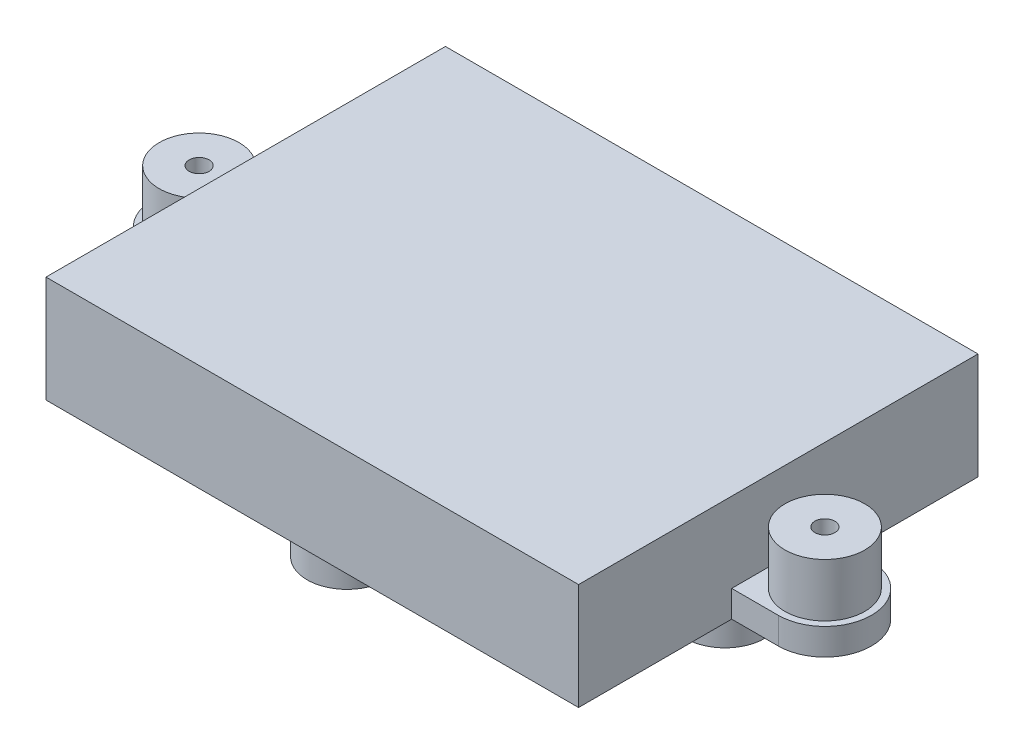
ISO-10303-21;
HEADER;
FILE_DESCRIPTION(('STEP AP214'),'2;1');
FILE_NAME('part.step','',(''),(''),'','','');
FILE_SCHEMA(('AUTOMOTIVE_DESIGN { 1 0 10303 214 1 1 1 1 }'));
ENDSEC;
DATA;
#1=APPLICATION_CONTEXT('core data for automotive mechanical design processes');
#2=APPLICATION_PROTOCOL_DEFINITION('international standard','automotive_design',2000,#1);
#3=PRODUCT_CONTEXT('',#1,'mechanical');
#4=PRODUCT('Part','Part','',(#3));
#5=PRODUCT_RELATED_PRODUCT_CATEGORY('part','',(#4));
#6=PRODUCT_DEFINITION_FORMATION('','',#4);
#7=PRODUCT_DEFINITION_CONTEXT('part definition',#1,'design');
#8=PRODUCT_DEFINITION('design','',#6,#7);
#9=PRODUCT_DEFINITION_SHAPE('','',#8);
#10=(LENGTH_UNIT() NAMED_UNIT(*) SI_UNIT(.MILLI.,.METRE.));
#11=(NAMED_UNIT(*) PLANE_ANGLE_UNIT() SI_UNIT($,.RADIAN.));
#12=(NAMED_UNIT(*) SI_UNIT($,.STERADIAN.) SOLID_ANGLE_UNIT());
#13=UNCERTAINTY_MEASURE_WITH_UNIT(LENGTH_MEASURE(1.E-05),#10,'distance_accuracy_value','');
#14=(GEOMETRIC_REPRESENTATION_CONTEXT(3) GLOBAL_UNCERTAINTY_ASSIGNED_CONTEXT((#13)) GLOBAL_UNIT_ASSIGNED_CONTEXT((#10,
#11,#12)) REPRESENTATION_CONTEXT('',''));
#15=CARTESIAN_POINT('',(0.,0.,0.));
#16=DIRECTION('',(0.,0.,1.));
#17=DIRECTION('',(1.,0.,0.));
#18=AXIS2_PLACEMENT_3D('',#15,#16,#17);
#19=CARTESIAN_POINT('',(-28.,-4.,15.));
#20=DIRECTION('',(0.,1.,0.));
#21=DIRECTION('',(0.,0.,1.));
#22=AXIS2_PLACEMENT_3D('',#19,#20,#21);
#23=PLANE('',#22);
#24=CARTESIAN_POINT('',(-1.9999999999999,-4.,10.3923048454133));
#25=DIRECTION('',(0.,-1.,0.));
#26=DIRECTION('',(0.866025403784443,0.,0.499999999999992));
#27=AXIS2_PLACEMENT_3D('',#24,#25,#26);
#28=CIRCLE('',#27,3.);
#29=CARTESIAN_POINT('',(0.765198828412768,-4.,11.555780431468));
#30=VERTEX_POINT('',#29);
#31=CARTESIAN_POINT('',(-4.39019882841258,-4.,8.57931020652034));
#32=VERTEX_POINT('',#31);
#33=EDGE_CURVE('E288',#30,#32,#28,.T.);
#34=ORIENTED_EDGE('',*,*,#33,.F.);
#35=CARTESIAN_POINT('',(4.,-4.,0.));
#36=DIRECTION('',(0.,1.,0.));
#37=DIRECTION('',(0.,0.,1.));
#38=AXIS2_PLACEMENT_3D('',#35,#36,#37);
#39=CIRCLE('',#38,12.);
#40=CARTESIAN_POINT('',(15.625,-4.,2.97647022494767));
#41=VERTEX_POINT('',#40);
#42=EDGE_CURVE('E222',#41,#30,#39,.F.);
#43=ORIENTED_EDGE('',*,*,#42,.F.);
#44=CARTESIAN_POINT('',(16.,-4.,0.));
#45=DIRECTION('',(0.,-1.,0.));
#46=DIRECTION('',(0.,0.,-1.));
#47=AXIS2_PLACEMENT_3D('',#44,#45,#46);
#48=CIRCLE('',#47,3.);
#49=CARTESIAN_POINT('',(15.625,-4.,-2.97647022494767));
#50=VERTEX_POINT('',#49);
#51=EDGE_CURVE('E309',#50,#41,#48,.T.);
#52=ORIENTED_EDGE('',*,*,#51,.F.);
#53=CARTESIAN_POINT('',(0.765198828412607,-4.,-11.5557804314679));
#54=VERTEX_POINT('',#53);
#55=EDGE_CURVE('E221',#54,#50,#39,.F.);
#56=ORIENTED_EDGE('',*,*,#55,.F.);
#57=CARTESIAN_POINT('',(-2.00000000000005,-4.,-10.3923048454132));
#58=DIRECTION('',(0.,-1.,0.));
#59=DIRECTION('',(-0.866025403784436,0.,0.500000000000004));
#60=AXIS2_PLACEMENT_3D('',#57,#58,#59);
#61=CIRCLE('',#60,3.);
#62=CARTESIAN_POINT('',(-4.3901988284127,-4.,-8.57931020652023));
#63=VERTEX_POINT('',#62);
#64=EDGE_CURVE('E301',#63,#54,#61,.T.);
#65=ORIENTED_EDGE('',*,*,#64,.F.);
#66=EDGE_CURVE('E226',#32,#63,#39,.F.);
#67=ORIENTED_EDGE('',*,*,#66,.F.);
#68=EDGE_LOOP('',(#34,#43,#52,#56,#65,#67));
#69=FACE_BOUND('',#68,.T.);
#70=CARTESIAN_POINT('',(23.5,-4.,0.));
#71=DIRECTION('',(0.,1.,0.));
#72=DIRECTION('',(0.,0.,1.));
#73=AXIS2_PLACEMENT_3D('',#70,#71,#72);
#74=CIRCLE('',#73,0.750000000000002);
#75=CARTESIAN_POINT('',(23.5,-4.,0.749999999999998));
#76=VERTEX_POINT('',#75);
#77=EDGE_CURVE('E186',#76,#76,#74,.T.);
#78=ORIENTED_EDGE('',*,*,#77,.T.);
#79=EDGE_LOOP('',(#78));
#80=FACE_BOUND('',#79,.T.);
#81=CARTESIAN_POINT('',(-23.5,-4.,0.));
#82=DIRECTION('',(0.,1.,0.));
#83=DIRECTION('',(0.,0.,-1.));
#84=AXIS2_PLACEMENT_3D('',#81,#82,#83);
#85=CIRCLE('',#84,0.750000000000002);
#86=CARTESIAN_POINT('',(-23.5,-4.,-0.749999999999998));
#87=VERTEX_POINT('',#86);
#88=EDGE_CURVE('E252',#87,#87,#85,.T.);
#89=ORIENTED_EDGE('',*,*,#88,.T.);
#90=EDGE_LOOP('',(#89));
#91=FACE_BOUND('',#90,.T.);
#92=DIRECTION('',(0.,0.,1.));
#93=VECTOR('',#92,1.);
#94=CARTESIAN_POINT('',(-20.,-4.,15.));
#95=LINE('',#94,#93);
#96=CARTESIAN_POINT('',(-20.,-4.,-15.));
#97=VERTEX_POINT('',#96);
#98=CARTESIAN_POINT('',(-20.,-4.,-3.5));
#99=VERTEX_POINT('',#98);
#100=EDGE_CURVE('E657',#97,#99,#95,.T.);
#101=ORIENTED_EDGE('',*,*,#100,.F.);
#102=DIRECTION('',(1.,0.,0.));
#103=VECTOR('',#102,1.);
#104=CARTESIAN_POINT('',(-28.,-4.,-15.));
#105=LINE('',#104,#103);
#106=CARTESIAN_POINT('',(20.,-4.,-15.));
#107=VERTEX_POINT('',#106);
#108=EDGE_CURVE('E208',#97,#107,#105,.T.);
#109=ORIENTED_EDGE('',*,*,#108,.T.);
#110=DIRECTION('',(0.,0.,1.));
#111=VECTOR('',#110,1.);
#112=CARTESIAN_POINT('',(20.,-4.,15.));
#113=LINE('',#112,#111);
#114=CARTESIAN_POINT('',(20.,-4.,-3.5));
#115=VERTEX_POINT('',#114);
#116=EDGE_CURVE('E285',#107,#115,#113,.T.);
#117=ORIENTED_EDGE('',*,*,#116,.T.);
#118=DIRECTION('',(1.,0.,0.));
#119=VECTOR('',#118,1.);
#120=CARTESIAN_POINT('',(-28.,-4.,-3.49999999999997));
#121=LINE('',#120,#119);
#122=CARTESIAN_POINT('',(23.5,-4.,-3.5));
#123=VERTEX_POINT('',#122);
#124=EDGE_CURVE('E639',#115,#123,#121,.T.);
#125=ORIENTED_EDGE('',*,*,#124,.T.);
#126=CARTESIAN_POINT('',(23.5,-4.,0.));
#127=DIRECTION('',(0.,1.,0.));
#128=DIRECTION('',(0.,0.,1.));
#129=AXIS2_PLACEMENT_3D('',#126,#127,#128);
#130=CIRCLE('',#129,3.5);
#131=CARTESIAN_POINT('',(23.5,-4.,3.5));
#132=VERTEX_POINT('',#131);
#133=EDGE_CURVE('E290',#123,#132,#130,.F.);
#134=ORIENTED_EDGE('',*,*,#133,.T.);
#135=DIRECTION('',(-1.,0.,0.));
#136=VECTOR('',#135,1.);
#137=CARTESIAN_POINT('',(-28.,-4.,3.49999999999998));
#138=LINE('',#137,#136);
#139=CARTESIAN_POINT('',(20.,-4.,3.5));
#140=VERTEX_POINT('',#139);
#141=EDGE_CURVE('E284',#132,#140,#138,.T.);
#142=ORIENTED_EDGE('',*,*,#141,.T.);
#143=DIRECTION('',(0.,0.,1.));
#144=VECTOR('',#143,1.);
#145=CARTESIAN_POINT('',(20.,-4.,15.));
#146=LINE('',#145,#144);
#147=CARTESIAN_POINT('',(20.,-4.,15.));
#148=VERTEX_POINT('',#147);
#149=EDGE_CURVE('E278',#140,#148,#146,.T.);
#150=ORIENTED_EDGE('',*,*,#149,.T.);
#151=DIRECTION('',(1.,0.,0.));
#152=VECTOR('',#151,1.);
#153=CARTESIAN_POINT('',(-28.,-4.,15.));
#154=LINE('',#153,#152);
#155=CARTESIAN_POINT('',(-20.,-4.,15.));
#156=VERTEX_POINT('',#155);
#157=EDGE_CURVE('E213',#156,#148,#154,.T.);
#158=ORIENTED_EDGE('',*,*,#157,.F.);
#159=DIRECTION('',(0.,0.,1.));
#160=VECTOR('',#159,1.);
#161=CARTESIAN_POINT('',(-20.,-4.,15.));
#162=LINE('',#161,#160);
#163=CARTESIAN_POINT('',(-20.,-4.,3.5));
#164=VERTEX_POINT('',#163);
#165=EDGE_CURVE('E624',#164,#156,#162,.T.);
#166=ORIENTED_EDGE('',*,*,#165,.F.);
#167=DIRECTION('',(1.,0.,0.));
#168=VECTOR('',#167,1.);
#169=CARTESIAN_POINT('',(-28.,-4.,3.5));
#170=LINE('',#169,#168);
#171=CARTESIAN_POINT('',(-23.5,-4.,3.5));
#172=VERTEX_POINT('',#171);
#173=EDGE_CURVE('E162',#172,#164,#170,.T.);
#174=ORIENTED_EDGE('',*,*,#173,.F.);
#175=CARTESIAN_POINT('',(-23.5,-4.,0.));
#176=DIRECTION('',(0.,1.,0.));
#177=DIRECTION('',(0.,0.,1.));
#178=AXIS2_PLACEMENT_3D('',#175,#176,#177);
#179=CIRCLE('',#178,3.5);
#180=CARTESIAN_POINT('',(-23.5,-4.,-3.5));
#181=VERTEX_POINT('',#180);
#182=EDGE_CURVE('E620',#181,#172,#179,.T.);
#183=ORIENTED_EDGE('',*,*,#182,.F.);
#184=DIRECTION('',(-1.,0.,0.));
#185=VECTOR('',#184,1.);
#186=CARTESIAN_POINT('',(-28.,-4.,-3.5));
#187=LINE('',#186,#185);
#188=EDGE_CURVE('E615',#99,#181,#187,.T.);
#189=ORIENTED_EDGE('',*,*,#188,.F.);
#190=EDGE_LOOP('',(#101,#109,#117,#125,#134,#142,#150,#158,#166,#174,#183,#189));
#191=FACE_BOUND('',#190,.T.);
#192=ADVANCED_FACE('F31',(#69,#80,#91,#191),#23,.F.);
#193=CARTESIAN_POINT('',(-20.,-2.,15.));
#194=DIRECTION('',(0.,1.,0.));
#195=DIRECTION('',(0.,0.,1.));
#196=AXIS2_PLACEMENT_3D('',#193,#194,#195);
#197=PLANE('',#196);
#198=CARTESIAN_POINT('',(-23.5,-2.,0.));
#199=DIRECTION('',(0.,1.,0.));
#200=DIRECTION('',(0.,0.,-1.));
#201=AXIS2_PLACEMENT_3D('',#198,#199,#200);
#202=CIRCLE('',#201,3.);
#203=CARTESIAN_POINT('',(-23.5,-2.,-3.));
#204=VERTEX_POINT('',#203);
#205=EDGE_CURVE('E256',#204,#204,#202,.T.);
#206=ORIENTED_EDGE('',*,*,#205,.F.);
#207=EDGE_LOOP('',(#206));
#208=FACE_BOUND('',#207,.T.);
#209=DIRECTION('',(0.,0.,-1.));
#210=VECTOR('',#209,1.);
#211=CARTESIAN_POINT('',(-20.,-2.,15.));
#212=LINE('',#211,#210);
#213=CARTESIAN_POINT('',(-20.,-2.,3.5));
#214=VERTEX_POINT('',#213);
#215=CARTESIAN_POINT('',(-20.,-2.,-3.5));
#216=VERTEX_POINT('',#215);
#217=EDGE_CURVE('E174',#214,#216,#212,.T.);
#218=ORIENTED_EDGE('',*,*,#217,.T.);
#219=DIRECTION('',(-1.,0.,0.));
#220=VECTOR('',#219,1.);
#221=CARTESIAN_POINT('',(-20.,-2.,-3.5));
#222=LINE('',#221,#220);
#223=CARTESIAN_POINT('',(-23.5,-2.,-3.5));
#224=VERTEX_POINT('',#223);
#225=EDGE_CURVE('E168',#216,#224,#222,.T.);
#226=ORIENTED_EDGE('',*,*,#225,.T.);
#227=CARTESIAN_POINT('',(-23.5,-2.,0.));
#228=DIRECTION('',(0.,1.,0.));
#229=DIRECTION('',(0.,0.,-1.));
#230=AXIS2_PLACEMENT_3D('',#227,#228,#229);
#231=CIRCLE('',#230,3.5);
#232=CARTESIAN_POINT('',(-23.5,-2.,3.5));
#233=VERTEX_POINT('',#232);
#234=EDGE_CURVE('E176',#224,#233,#231,.T.);
#235=ORIENTED_EDGE('',*,*,#234,.T.);
#236=DIRECTION('',(1.,0.,0.));
#237=VECTOR('',#236,1.);
#238=CARTESIAN_POINT('',(-20.,-2.,3.5));
#239=LINE('',#238,#237);
#240=EDGE_CURVE('E159',#233,#214,#239,.T.);
#241=ORIENTED_EDGE('',*,*,#240,.T.);
#242=EDGE_LOOP('',(#218,#226,#235,#241));
#243=FACE_BOUND('',#242,.T.);
#244=ADVANCED_FACE('F172',(#208,#243),#197,.T.);
#245=CARTESIAN_POINT('',(-28.,-4.,15.));
#246=DIRECTION('',(0.,0.,1.));
#247=DIRECTION('',(1.,0.,0.));
#248=AXIS2_PLACEMENT_3D('',#245,#246,#247);
#249=PLANE('',#248);
#250=DIRECTION('',(0.,-1.,0.));
#251=VECTOR('',#250,1.);
#252=CARTESIAN_POINT('',(-20.,4.,15.));
#253=LINE('',#252,#251);
#254=CARTESIAN_POINT('',(-20.,4.,15.));
#255=VERTEX_POINT('',#254);
#256=EDGE_CURVE('E264',#255,#156,#253,.T.);
#257=ORIENTED_EDGE('',*,*,#256,.T.);
#258=ORIENTED_EDGE('',*,*,#157,.T.);
#259=DIRECTION('',(0.,-1.,0.));
#260=VECTOR('',#259,1.);
#261=CARTESIAN_POINT('',(20.,4.,15.));
#262=LINE('',#261,#260);
#263=CARTESIAN_POINT('',(20.,4.,15.));
#264=VERTEX_POINT('',#263);
#265=EDGE_CURVE('E198',#264,#148,#262,.T.);
#266=ORIENTED_EDGE('',*,*,#265,.F.);
#267=DIRECTION('',(-1.,0.,0.));
#268=VECTOR('',#267,1.);
#269=CARTESIAN_POINT('',(-28.,4.,15.));
#270=LINE('',#269,#268);
#271=EDGE_CURVE('E215',#264,#255,#270,.T.);
#272=ORIENTED_EDGE('',*,*,#271,.T.);
#273=EDGE_LOOP('',(#257,#258,#266,#272));
#274=FACE_BOUND('',#273,.T.);
#275=ADVANCED_FACE('F273',(#274),#249,.T.);
#276=CARTESIAN_POINT('',(-28.,-4.,-15.));
#277=DIRECTION('',(0.,0.,1.));
#278=DIRECTION('',(1.,0.,0.));
#279=AXIS2_PLACEMENT_3D('',#276,#277,#278);
#280=PLANE('',#279);
#281=ORIENTED_EDGE('',*,*,#108,.F.);
#282=DIRECTION('',(0.,1.,0.));
#283=VECTOR('',#282,1.);
#284=CARTESIAN_POINT('',(-20.,4.,-15.));
#285=LINE('',#284,#283);
#286=CARTESIAN_POINT('',(-20.,4.,-15.));
#287=VERTEX_POINT('',#286);
#288=EDGE_CURVE('E183',#97,#287,#285,.T.);
#289=ORIENTED_EDGE('',*,*,#288,.T.);
#290=DIRECTION('',(-1.,0.,0.));
#291=VECTOR('',#290,1.);
#292=CARTESIAN_POINT('',(-28.,4.,-15.));
#293=LINE('',#292,#291);
#294=CARTESIAN_POINT('',(20.,4.,-15.));
#295=VERTEX_POINT('',#294);
#296=EDGE_CURVE('E210',#295,#287,#293,.T.);
#297=ORIENTED_EDGE('',*,*,#296,.F.);
#298=DIRECTION('',(0.,1.,0.));
#299=VECTOR('',#298,1.);
#300=CARTESIAN_POINT('',(20.,4.,-15.));
#301=LINE('',#300,#299);
#302=EDGE_CURVE('E204',#107,#295,#301,.T.);
#303=ORIENTED_EDGE('',*,*,#302,.F.);
#304=EDGE_LOOP('',(#281,#289,#297,#303));
#305=FACE_BOUND('',#304,.T.);
#306=ADVANCED_FACE('F354',(#305),#280,.F.);
#307=CARTESIAN_POINT('',(4.,-6.,0.));
#308=DIRECTION('',(0.,1.,0.));
#309=DIRECTION('',(0.,0.,1.));
#310=AXIS2_PLACEMENT_3D('',#307,#308,#309);
#311=CYLINDRICAL_SURFACE('',#310,12.);
#312=DIRECTION('',(0.,1.,0.));
#313=VECTOR('',#312,1.);
#314=CARTESIAN_POINT('',(0.765198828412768,-5.75,11.555780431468));
#315=LINE('',#314,#313);
#316=CARTESIAN_POINT('',(0.765198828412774,-6.,11.555780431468));
#317=VERTEX_POINT('',#316);
#318=EDGE_CURVE('E299',#317,#30,#315,.T.);
#319=ORIENTED_EDGE('',*,*,#318,.F.);
#320=CARTESIAN_POINT('',(4.,-6.,0.));
#321=DIRECTION('',(0.,-1.,0.));
#322=DIRECTION('',(0.,0.,-1.));
#323=AXIS2_PLACEMENT_3D('',#320,#321,#322);
#324=CIRCLE('',#323,12.);
#325=CARTESIAN_POINT('',(15.625,-6.,2.97647022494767));
#326=VERTEX_POINT('',#325);
#327=EDGE_CURVE('E245',#326,#317,#324,.T.);
#328=ORIENTED_EDGE('',*,*,#327,.F.);
#329=DIRECTION('',(0.,1.,0.));
#330=VECTOR('',#329,1.);
#331=CARTESIAN_POINT('',(15.625,-5.75,2.97647022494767));
#332=LINE('',#331,#330);
#333=EDGE_CURVE('E246',#41,#326,#332,.F.);
#334=ORIENTED_EDGE('',*,*,#333,.F.);
#335=ORIENTED_EDGE('',*,*,#42,.T.);
#336=EDGE_LOOP('',(#319,#328,#334,#335));
#337=FACE_BOUND('',#336,.T.);
#338=ADVANCED_FACE('F321',(#337),#311,.T.);
#339=DIRECTION('',(0.,1.,0.));
#340=VECTOR('',#339,1.);
#341=CARTESIAN_POINT('',(-4.39019882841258,-5.75,8.57931020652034));
#342=LINE('',#341,#340);
#343=CARTESIAN_POINT('',(-4.39019882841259,-6.,8.57931020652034));
#344=VERTEX_POINT('',#343);
#345=EDGE_CURVE('E45',#32,#344,#342,.F.);
#346=ORIENTED_EDGE('',*,*,#345,.F.);
#347=ORIENTED_EDGE('',*,*,#66,.T.);
#348=DIRECTION('',(0.,1.,0.));
#349=VECTOR('',#348,1.);
#350=CARTESIAN_POINT('',(-4.3901988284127,-5.75,-8.57931020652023));
#351=LINE('',#350,#349);
#352=CARTESIAN_POINT('',(-4.3901988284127,-6.,-8.57931020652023));
#353=VERTEX_POINT('',#352);
#354=EDGE_CURVE('E307',#353,#63,#351,.T.);
#355=ORIENTED_EDGE('',*,*,#354,.F.);
#356=EDGE_CURVE('E235',#344,#353,#324,.T.);
#357=ORIENTED_EDGE('',*,*,#356,.F.);
#358=EDGE_LOOP('',(#346,#347,#355,#357));
#359=FACE_BOUND('',#358,.T.);
#360=ADVANCED_FACE('F329',(#359),#311,.T.);
#361=CARTESIAN_POINT('',(4.,-6.,0.));
#362=DIRECTION('',(0.,-1.,0.));
#363=DIRECTION('',(0.,0.,-1.));
#364=AXIS2_PLACEMENT_3D('',#361,#362,#363);
#365=PLANE('',#364);
#366=ORIENTED_EDGE('',*,*,#327,.T.);
#367=CARTESIAN_POINT('',(-1.9999999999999,-6.,10.3923048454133));
#368=DIRECTION('',(0.,-1.,0.));
#369=DIRECTION('',(0.,0.,-1.));
#370=AXIS2_PLACEMENT_3D('',#367,#368,#369);
#371=CIRCLE('',#370,3.);
#372=EDGE_CURVE('E11',#317,#344,#371,.F.);
#373=ORIENTED_EDGE('',*,*,#372,.T.);
#374=ORIENTED_EDGE('',*,*,#356,.T.);
#375=CARTESIAN_POINT('',(-2.00000000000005,-6.,-10.3923048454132));
#376=DIRECTION('',(0.,-1.,0.));
#377=DIRECTION('',(0.,0.,-1.));
#378=AXIS2_PLACEMENT_3D('',#375,#376,#377);
#379=CIRCLE('',#378,3.);
#380=CARTESIAN_POINT('',(0.765198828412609,-6.,-11.5557804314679));
#381=VERTEX_POINT('',#380);
#382=EDGE_CURVE('E38',#353,#381,#379,.F.);
#383=ORIENTED_EDGE('',*,*,#382,.T.);
#384=CARTESIAN_POINT('',(15.625,-6.,-2.97647022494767));
#385=VERTEX_POINT('',#384);
#386=EDGE_CURVE('E232',#381,#385,#324,.T.);
#387=ORIENTED_EDGE('',*,*,#386,.T.);
#388=CARTESIAN_POINT('',(16.,-6.,0.));
#389=DIRECTION('',(0.,-1.,0.));
#390=DIRECTION('',(0.,0.,-1.));
#391=AXIS2_PLACEMENT_3D('',#388,#389,#390);
#392=CIRCLE('',#391,3.);
#393=EDGE_CURVE('E225',#385,#326,#392,.F.);
#394=ORIENTED_EDGE('',*,*,#393,.T.);
#395=EDGE_LOOP('',(#366,#373,#374,#383,#387,#394));
#396=FACE_BOUND('',#395,.T.);
#397=ADVANCED_FACE('F231',(#396),#365,.T.);
#398=DIRECTION('',(0.,1.,0.));
#399=VECTOR('',#398,1.);
#400=CARTESIAN_POINT('',(0.765198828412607,-5.75,-11.5557804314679));
#401=LINE('',#400,#399);
#402=EDGE_CURVE('E52',#54,#381,#401,.F.);
#403=ORIENTED_EDGE('',*,*,#402,.F.);
#404=ORIENTED_EDGE('',*,*,#55,.T.);
#405=DIRECTION('',(0.,1.,0.));
#406=VECTOR('',#405,1.);
#407=CARTESIAN_POINT('',(15.625,-5.75,-2.97647022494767));
#408=LINE('',#407,#406);
#409=EDGE_CURVE('E243',#385,#50,#408,.T.);
#410=ORIENTED_EDGE('',*,*,#409,.F.);
#411=ORIENTED_EDGE('',*,*,#386,.F.);
#412=EDGE_LOOP('',(#403,#404,#410,#411));
#413=FACE_BOUND('',#412,.T.);
#414=ADVANCED_FACE('F240',(#413),#311,.T.);
#415=CARTESIAN_POINT('',(-23.5,2.,0.));
#416=DIRECTION('',(0.,1.,0.));
#417=DIRECTION('',(0.,0.,-1.));
#418=AXIS2_PLACEMENT_3D('',#415,#416,#417);
#419=PLANE('',#418);
#420=CARTESIAN_POINT('',(-23.5,2.,0.));
#421=DIRECTION('',(0.,1.,0.));
#422=DIRECTION('',(0.,0.,-1.));
#423=AXIS2_PLACEMENT_3D('',#420,#421,#422);
#424=CIRCLE('',#423,3.);
#425=CARTESIAN_POINT('',(-23.5,2.,-3.));
#426=VERTEX_POINT('',#425);
#427=EDGE_CURVE('E261',#426,#426,#424,.T.);
#428=ORIENTED_EDGE('',*,*,#427,.T.);
#429=EDGE_LOOP('',(#428));
#430=FACE_BOUND('',#429,.T.);
#431=CARTESIAN_POINT('',(-23.5,2.,0.));
#432=DIRECTION('',(0.,-1.,0.));
#433=DIRECTION('',(0.,0.,1.));
#434=AXIS2_PLACEMENT_3D('',#431,#432,#433);
#435=CIRCLE('',#434,0.750000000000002);
#436=CARTESIAN_POINT('',(-23.5,2.,0.749999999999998));
#437=VERTEX_POINT('',#436);
#438=EDGE_CURVE('E249',#437,#437,#435,.T.);
#439=ORIENTED_EDGE('',*,*,#438,.T.);
#440=EDGE_LOOP('',(#439));
#441=FACE_BOUND('',#440,.T.);
#442=ADVANCED_FACE('F385',(#430,#441),#419,.T.);
#443=CARTESIAN_POINT('',(-23.5,-4.,0.));
#444=DIRECTION('',(0.,1.,0.));
#445=DIRECTION('',(0.,0.,1.));
#446=AXIS2_PLACEMENT_3D('',#443,#444,#445);
#447=CYLINDRICAL_SURFACE('',#446,0.750000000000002);
#448=ORIENTED_EDGE('',*,*,#88,.F.);
#449=EDGE_LOOP('',(#448));
#450=FACE_BOUND('',#449,.T.);
#451=ORIENTED_EDGE('',*,*,#438,.F.);
#452=EDGE_LOOP('',(#451));
#453=FACE_BOUND('',#452,.T.);
#454=ADVANCED_FACE('F381',(#450,#453),#447,.F.);
#455=CARTESIAN_POINT('',(-28.,4.,15.));
#456=DIRECTION('',(0.,-1.,0.));
#457=DIRECTION('',(0.,0.,-1.));
#458=AXIS2_PLACEMENT_3D('',#455,#456,#457);
#459=PLANE('',#458);
#460=DIRECTION('',(0.,0.,1.));
#461=VECTOR('',#460,1.);
#462=CARTESIAN_POINT('',(-20.,4.,15.));
#463=LINE('',#462,#461);
#464=EDGE_CURVE('E189',#287,#255,#463,.T.);
#465=ORIENTED_EDGE('',*,*,#464,.T.);
#466=ORIENTED_EDGE('',*,*,#271,.F.);
#467=DIRECTION('',(0.,0.,1.));
#468=VECTOR('',#467,1.);
#469=CARTESIAN_POINT('',(20.,4.,15.));
#470=LINE('',#469,#468);
#471=EDGE_CURVE('E206',#295,#264,#470,.T.);
#472=ORIENTED_EDGE('',*,*,#471,.F.);
#473=ORIENTED_EDGE('',*,*,#296,.T.);
#474=EDGE_LOOP('',(#465,#466,#472,#473));
#475=FACE_BOUND('',#474,.T.);
#476=ADVANCED_FACE('F268',(#475),#459,.F.);
#477=CARTESIAN_POINT('',(23.5,2.,0.));
#478=DIRECTION('',(0.,1.,0.));
#479=DIRECTION('',(0.,0.,1.));
#480=AXIS2_PLACEMENT_3D('',#477,#478,#479);
#481=PLANE('',#480);
#482=CARTESIAN_POINT('',(23.5,2.,0.));
#483=DIRECTION('',(0.,1.,0.));
#484=DIRECTION('',(0.,0.,1.));
#485=AXIS2_PLACEMENT_3D('',#482,#483,#484);
#486=CIRCLE('',#485,3.);
#487=CARTESIAN_POINT('',(23.5,2.,3.));
#488=VERTEX_POINT('',#487);
#489=EDGE_CURVE('E195',#488,#488,#486,.T.);
#490=ORIENTED_EDGE('',*,*,#489,.T.);
#491=EDGE_LOOP('',(#490));
#492=FACE_BOUND('',#491,.T.);
#493=CARTESIAN_POINT('',(23.5,2.,0.));
#494=DIRECTION('',(0.,-1.,0.));
#495=DIRECTION('',(0.,0.,-1.));
#496=AXIS2_PLACEMENT_3D('',#493,#494,#495);
#497=CIRCLE('',#496,0.750000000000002);
#498=CARTESIAN_POINT('',(23.5,2.,-0.749999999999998));
#499=VERTEX_POINT('',#498);
#500=EDGE_CURVE('E182',#499,#499,#497,.T.);
#501=ORIENTED_EDGE('',*,*,#500,.T.);
#502=EDGE_LOOP('',(#501));
#503=FACE_BOUND('',#502,.T.);
#504=ADVANCED_FACE('F364',(#492,#503),#481,.T.);
#505=CARTESIAN_POINT('',(23.5,-4.,0.));
#506=DIRECTION('',(0.,1.,0.));
#507=DIRECTION('',(0.,0.,1.));
#508=AXIS2_PLACEMENT_3D('',#505,#506,#507);
#509=CYLINDRICAL_SURFACE('',#508,0.750000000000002);
#510=ORIENTED_EDGE('',*,*,#77,.F.);
#511=EDGE_LOOP('',(#510));
#512=FACE_BOUND('',#511,.T.);
#513=ORIENTED_EDGE('',*,*,#500,.F.);
#514=EDGE_LOOP('',(#513));
#515=FACE_BOUND('',#514,.T.);
#516=ADVANCED_FACE('F360',(#512,#515),#509,.F.);
#517=CARTESIAN_POINT('',(20.,-2.,15.));
#518=DIRECTION('',(0.,-1.,0.));
#519=DIRECTION('',(0.,0.,-1.));
#520=AXIS2_PLACEMENT_3D('',#517,#518,#519);
#521=PLANE('',#520);
#522=DIRECTION('',(0.,0.,-1.));
#523=VECTOR('',#522,1.);
#524=CARTESIAN_POINT('',(20.,-2.,15.));
#525=LINE('',#524,#523);
#526=CARTESIAN_POINT('',(20.,-2.,3.5));
#527=VERTEX_POINT('',#526);
#528=CARTESIAN_POINT('',(20.,-2.,-3.5));
#529=VERTEX_POINT('',#528);
#530=EDGE_CURVE('E201',#527,#529,#525,.T.);
#531=ORIENTED_EDGE('',*,*,#530,.F.);
#532=DIRECTION('',(-1.,0.,0.));
#533=VECTOR('',#532,1.);
#534=CARTESIAN_POINT('',(20.,-2.,3.5));
#535=LINE('',#534,#533);
#536=CARTESIAN_POINT('',(23.5,-2.,3.5));
#537=VERTEX_POINT('',#536);
#538=EDGE_CURVE('E633',#537,#527,#535,.T.);
#539=ORIENTED_EDGE('',*,*,#538,.F.);
#540=CARTESIAN_POINT('',(23.5,-2.,0.));
#541=DIRECTION('',(0.,-1.,0.));
#542=DIRECTION('',(0.,0.,-1.));
#543=AXIS2_PLACEMENT_3D('',#540,#541,#542);
#544=CIRCLE('',#543,3.5);
#545=CARTESIAN_POINT('',(23.5,-2.,-3.5));
#546=VERTEX_POINT('',#545);
#547=EDGE_CURVE('E630',#546,#537,#544,.T.);
#548=ORIENTED_EDGE('',*,*,#547,.F.);
#549=DIRECTION('',(1.,0.,0.));
#550=VECTOR('',#549,1.);
#551=CARTESIAN_POINT('',(20.,-2.,-3.5));
#552=LINE('',#551,#550);
#553=EDGE_CURVE('E619',#529,#546,#552,.T.);
#554=ORIENTED_EDGE('',*,*,#553,.F.);
#555=EDGE_LOOP('',(#531,#539,#548,#554));
#556=FACE_BOUND('',#555,.T.);
#557=CARTESIAN_POINT('',(23.5,-2.,0.));
#558=DIRECTION('',(0.,-1.,0.));
#559=DIRECTION('',(0.,0.,-1.));
#560=AXIS2_PLACEMENT_3D('',#557,#558,#559);
#561=CIRCLE('',#560,3.);
#562=CARTESIAN_POINT('',(23.5,-2.,-3.00000000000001));
#563=VERTEX_POINT('',#562);
#564=EDGE_CURVE('E218',#563,#563,#561,.F.);
#565=ORIENTED_EDGE('',*,*,#564,.F.);
#566=EDGE_LOOP('',(#565));
#567=FACE_BOUND('',#566,.T.);
#568=ADVANCED_FACE('F363',(#556,#567),#521,.F.);
#569=CARTESIAN_POINT('',(20.,-2.,15.));
#570=DIRECTION('',(1.,0.,0.));
#571=DIRECTION('',(0.,0.,-1.));
#572=AXIS2_PLACEMENT_3D('',#569,#570,#571);
#573=PLANE('',#572);
#574=ORIENTED_EDGE('',*,*,#265,.T.);
#575=ORIENTED_EDGE('',*,*,#149,.F.);
#576=DIRECTION('',(0.,1.,0.));
#577=VECTOR('',#576,1.);
#578=CARTESIAN_POINT('',(20.,-7.5,3.5));
#579=LINE('',#578,#577);
#580=EDGE_CURVE('E637',#140,#527,#579,.T.);
#581=ORIENTED_EDGE('',*,*,#580,.T.);
#582=ORIENTED_EDGE('',*,*,#530,.T.);
#583=DIRECTION('',(0.,1.,0.));
#584=VECTOR('',#583,1.);
#585=CARTESIAN_POINT('',(20.,-7.5,-3.5));
#586=LINE('',#585,#584);
#587=EDGE_CURVE('E636',#115,#529,#586,.T.);
#588=ORIENTED_EDGE('',*,*,#587,.F.);
#589=ORIENTED_EDGE('',*,*,#116,.F.);
#590=ORIENTED_EDGE('',*,*,#302,.T.);
#591=ORIENTED_EDGE('',*,*,#471,.T.);
#592=EDGE_LOOP('',(#574,#575,#581,#582,#588,#589,#590,#591));
#593=FACE_BOUND('',#592,.T.);
#594=ADVANCED_FACE('F277',(#593),#573,.T.);
#595=CARTESIAN_POINT('',(23.5,2.,0.));
#596=DIRECTION('',(0.,-1.,0.));
#597=DIRECTION('',(0.,0.,-1.));
#598=AXIS2_PLACEMENT_3D('',#595,#596,#597);
#599=CYLINDRICAL_SURFACE('',#598,3.);
#600=ORIENTED_EDGE('',*,*,#489,.F.);
#601=EDGE_LOOP('',(#600));
#602=FACE_BOUND('',#601,.T.);
#603=ORIENTED_EDGE('',*,*,#564,.T.);
#604=EDGE_LOOP('',(#603));
#605=FACE_BOUND('',#604,.T.);
#606=ADVANCED_FACE('F369',(#602,#605),#599,.T.);
#607=CARTESIAN_POINT('',(-20.,-2.,15.));
#608=DIRECTION('',(-1.,0.,0.));
#609=DIRECTION('',(0.,0.,-1.));
#610=AXIS2_PLACEMENT_3D('',#607,#608,#609);
#611=PLANE('',#610);
#612=ORIENTED_EDGE('',*,*,#256,.F.);
#613=ORIENTED_EDGE('',*,*,#464,.F.);
#614=ORIENTED_EDGE('',*,*,#288,.F.);
#615=ORIENTED_EDGE('',*,*,#100,.T.);
#616=DIRECTION('',(0.,1.,0.));
#617=VECTOR('',#616,1.);
#618=CARTESIAN_POINT('',(-20.,-7.5,-3.5));
#619=LINE('',#618,#617);
#620=EDGE_CURVE('E180',#99,#216,#619,.T.);
#621=ORIENTED_EDGE('',*,*,#620,.T.);
#622=ORIENTED_EDGE('',*,*,#217,.F.);
#623=DIRECTION('',(0.,1.,0.));
#624=VECTOR('',#623,1.);
#625=CARTESIAN_POINT('',(-20.,-7.5,3.5));
#626=LINE('',#625,#624);
#627=EDGE_CURVE('E155',#164,#214,#626,.T.);
#628=ORIENTED_EDGE('',*,*,#627,.F.);
#629=ORIENTED_EDGE('',*,*,#165,.T.);
#630=EDGE_LOOP('',(#612,#613,#614,#615,#621,#622,#628,#629));
#631=FACE_BOUND('',#630,.T.);
#632=ADVANCED_FACE('F178',(#631),#611,.T.);
#633=CARTESIAN_POINT('',(-23.5,2.,0.));
#634=DIRECTION('',(0.,-1.,0.));
#635=DIRECTION('',(0.,0.,-1.));
#636=AXIS2_PLACEMENT_3D('',#633,#634,#635);
#637=CYLINDRICAL_SURFACE('',#636,3.);
#638=ORIENTED_EDGE('',*,*,#427,.F.);
#639=EDGE_LOOP('',(#638));
#640=FACE_BOUND('',#639,.T.);
#641=ORIENTED_EDGE('',*,*,#205,.T.);
#642=EDGE_LOOP('',(#641));
#643=FACE_BOUND('',#642,.T.);
#644=ADVANCED_FACE('F397',(#640,#643),#637,.T.);
#645=CARTESIAN_POINT('',(16.,-7.5,0.));
#646=DIRECTION('',(0.,1.,0.));
#647=DIRECTION('',(0.,0.,1.));
#648=AXIS2_PLACEMENT_3D('',#645,#646,#647);
#649=CYLINDRICAL_SURFACE('',#648,3.);
#650=CARTESIAN_POINT('',(16.,-7.5,0.));
#651=DIRECTION('',(0.,-1.,0.));
#652=DIRECTION('',(0.,0.,-1.));
#653=AXIS2_PLACEMENT_3D('',#650,#651,#652);
#654=CIRCLE('',#653,3.);
#655=CARTESIAN_POINT('',(16.,-7.5,-3.));
#656=VERTEX_POINT('',#655);
#657=EDGE_CURVE('E311',#656,#656,#654,.T.);
#658=ORIENTED_EDGE('',*,*,#657,.F.);
#659=EDGE_LOOP('',(#658));
#660=FACE_BOUND('',#659,.T.);
#661=ORIENTED_EDGE('',*,*,#393,.F.);
#662=ORIENTED_EDGE('',*,*,#409,.T.);
#663=ORIENTED_EDGE('',*,*,#51,.T.);
#664=ORIENTED_EDGE('',*,*,#333,.T.);
#665=EDGE_LOOP('',(#661,#662,#663,#664));
#666=FACE_BOUND('',#665,.T.);
#667=ADVANCED_FACE('F316',(#660,#666),#649,.T.);
#668=CARTESIAN_POINT('',(16.,-7.5,0.));
#669=DIRECTION('',(0.,-1.,0.));
#670=DIRECTION('',(0.,0.,-1.));
#671=AXIS2_PLACEMENT_3D('',#668,#669,#670);
#672=PLANE('',#671);
#673=ORIENTED_EDGE('',*,*,#657,.T.);
#674=EDGE_LOOP('',(#673));
#675=FACE_BOUND('',#674,.T.);
#676=ADVANCED_FACE('F333',(#675),#672,.T.);
#677=CARTESIAN_POINT('',(-2.00000000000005,-7.5,-10.3923048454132));
#678=DIRECTION('',(0.,1.,0.));
#679=DIRECTION('',(0.,0.,1.));
#680=AXIS2_PLACEMENT_3D('',#677,#678,#679);
#681=CYLINDRICAL_SURFACE('',#680,3.);
#682=CARTESIAN_POINT('',(-2.00000000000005,-7.5,-10.3923048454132));
#683=DIRECTION('',(0.,-1.,0.));
#684=DIRECTION('',(-0.866025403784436,0.,0.500000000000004));
#685=AXIS2_PLACEMENT_3D('',#682,#683,#684);
#686=CIRCLE('',#685,3.);
#687=CARTESIAN_POINT('',(-4.59807621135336,-7.5,-8.89230484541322));
#688=VERTEX_POINT('',#687);
#689=EDGE_CURVE('E303',#688,#688,#686,.T.);
#690=ORIENTED_EDGE('',*,*,#689,.F.);
#691=EDGE_LOOP('',(#690));
#692=FACE_BOUND('',#691,.T.);
#693=ORIENTED_EDGE('',*,*,#382,.F.);
#694=ORIENTED_EDGE('',*,*,#354,.T.);
#695=ORIENTED_EDGE('',*,*,#64,.T.);
#696=ORIENTED_EDGE('',*,*,#402,.T.);
#697=EDGE_LOOP('',(#693,#694,#695,#696));
#698=FACE_BOUND('',#697,.T.);
#699=ADVANCED_FACE('F330',(#692,#698),#681,.T.);
#700=CARTESIAN_POINT('',(-2.00000000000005,-7.5,-10.3923048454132));
#701=DIRECTION('',(0.,-1.,0.));
#702=DIRECTION('',(-0.866025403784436,0.,0.500000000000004));
#703=AXIS2_PLACEMENT_3D('',#700,#701,#702);
#704=PLANE('',#703);
#705=ORIENTED_EDGE('',*,*,#689,.T.);
#706=EDGE_LOOP('',(#705));
#707=FACE_BOUND('',#706,.T.);
#708=ADVANCED_FACE('F332',(#707),#704,.T.);
#709=CARTESIAN_POINT('',(-1.9999999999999,-7.5,10.3923048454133));
#710=DIRECTION('',(0.,1.,0.));
#711=DIRECTION('',(0.,0.,1.));
#712=AXIS2_PLACEMENT_3D('',#709,#710,#711);
#713=CYLINDRICAL_SURFACE('',#712,3.);
#714=CARTESIAN_POINT('',(-1.9999999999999,-7.5,10.3923048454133));
#715=DIRECTION('',(0.,-1.,0.));
#716=DIRECTION('',(0.866025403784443,0.,0.499999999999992));
#717=AXIS2_PLACEMENT_3D('',#714,#715,#716);
#718=CIRCLE('',#717,3.);
#719=CARTESIAN_POINT('',(0.598076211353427,-7.5,11.8923048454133));
#720=VERTEX_POINT('',#719);
#721=EDGE_CURVE('E295',#720,#720,#718,.T.);
#722=ORIENTED_EDGE('',*,*,#721,.F.);
#723=EDGE_LOOP('',(#722));
#724=FACE_BOUND('',#723,.T.);
#725=ORIENTED_EDGE('',*,*,#372,.F.);
#726=ORIENTED_EDGE('',*,*,#318,.T.);
#727=ORIENTED_EDGE('',*,*,#33,.T.);
#728=ORIENTED_EDGE('',*,*,#345,.T.);
#729=EDGE_LOOP('',(#725,#726,#727,#728));
#730=FACE_BOUND('',#729,.T.);
#731=ADVANCED_FACE('F323',(#724,#730),#713,.T.);
#732=CARTESIAN_POINT('',(-1.9999999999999,-7.5,10.3923048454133));
#733=DIRECTION('',(0.,-1.,0.));
#734=DIRECTION('',(0.866025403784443,0.,0.499999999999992));
#735=AXIS2_PLACEMENT_3D('',#732,#733,#734);
#736=PLANE('',#735);
#737=ORIENTED_EDGE('',*,*,#721,.T.);
#738=EDGE_LOOP('',(#737));
#739=FACE_BOUND('',#738,.T.);
#740=ADVANCED_FACE('F542',(#739),#736,.T.);
#741=CARTESIAN_POINT('',(20.,-7.5,3.5));
#742=DIRECTION('',(0.,0.,-1.));
#743=DIRECTION('',(-1.,0.,0.));
#744=AXIS2_PLACEMENT_3D('',#741,#742,#743);
#745=PLANE('',#744);
#746=DIRECTION('',(0.,1.,0.));
#747=VECTOR('',#746,1.);
#748=CARTESIAN_POINT('',(23.5,-7.5,3.5));
#749=LINE('',#748,#747);
#750=EDGE_CURVE('E640',#132,#537,#749,.T.);
#751=ORIENTED_EDGE('',*,*,#750,.T.);
#752=ORIENTED_EDGE('',*,*,#538,.T.);
#753=ORIENTED_EDGE('',*,*,#580,.F.);
#754=ORIENTED_EDGE('',*,*,#141,.F.);
#755=EDGE_LOOP('',(#751,#752,#753,#754));
#756=FACE_BOUND('',#755,.T.);
#757=ADVANCED_FACE('F533',(#756),#745,.F.);
#758=CARTESIAN_POINT('',(23.5,-7.5,0.));
#759=DIRECTION('',(0.,1.,0.));
#760=DIRECTION('',(0.,0.,1.));
#761=AXIS2_PLACEMENT_3D('',#758,#759,#760);
#762=CYLINDRICAL_SURFACE('',#761,3.5);
#763=DIRECTION('',(0.,1.,0.));
#764=VECTOR('',#763,1.);
#765=CARTESIAN_POINT('',(23.5,-7.5,-3.5));
#766=LINE('',#765,#764);
#767=EDGE_CURVE('E642',#123,#546,#766,.T.);
#768=ORIENTED_EDGE('',*,*,#767,.T.);
#769=ORIENTED_EDGE('',*,*,#547,.T.);
#770=ORIENTED_EDGE('',*,*,#750,.F.);
#771=ORIENTED_EDGE('',*,*,#133,.F.);
#772=EDGE_LOOP('',(#768,#769,#770,#771));
#773=FACE_BOUND('',#772,.T.);
#774=ADVANCED_FACE('F523',(#773),#762,.T.);
#775=CARTESIAN_POINT('',(20.,-7.5,-3.5));
#776=DIRECTION('',(0.,0.,1.));
#777=DIRECTION('',(1.,0.,0.));
#778=AXIS2_PLACEMENT_3D('',#775,#776,#777);
#779=PLANE('',#778);
#780=ORIENTED_EDGE('',*,*,#587,.T.);
#781=ORIENTED_EDGE('',*,*,#553,.T.);
#782=ORIENTED_EDGE('',*,*,#767,.F.);
#783=ORIENTED_EDGE('',*,*,#124,.F.);
#784=EDGE_LOOP('',(#780,#781,#782,#783));
#785=FACE_BOUND('',#784,.T.);
#786=ADVANCED_FACE('F517',(#785),#779,.F.);
#787=CARTESIAN_POINT('',(-20.,-7.5,-3.5));
#788=DIRECTION('',(0.,0.,-1.));
#789=DIRECTION('',(-1.,0.,0.));
#790=AXIS2_PLACEMENT_3D('',#787,#788,#789);
#791=PLANE('',#790);
#792=ORIENTED_EDGE('',*,*,#188,.T.);
#793=DIRECTION('',(0.,1.,0.));
#794=VECTOR('',#793,1.);
#795=CARTESIAN_POINT('',(-23.5,-7.5,-3.5));
#796=LINE('',#795,#794);
#797=EDGE_CURVE('E617',#181,#224,#796,.T.);
#798=ORIENTED_EDGE('',*,*,#797,.T.);
#799=ORIENTED_EDGE('',*,*,#225,.F.);
#800=ORIENTED_EDGE('',*,*,#620,.F.);
#801=EDGE_LOOP('',(#792,#798,#799,#800));
#802=FACE_BOUND('',#801,.T.);
#803=ADVANCED_FACE('F522',(#802),#791,.T.);
#804=CARTESIAN_POINT('',(-23.5,-7.5,0.));
#805=DIRECTION('',(0.,1.,0.));
#806=DIRECTION('',(0.,0.,1.));
#807=AXIS2_PLACEMENT_3D('',#804,#805,#806);
#808=CYLINDRICAL_SURFACE('',#807,3.5);
#809=ORIENTED_EDGE('',*,*,#182,.T.);
#810=DIRECTION('',(0.,1.,0.));
#811=VECTOR('',#810,1.);
#812=CARTESIAN_POINT('',(-23.5,-7.5,3.5));
#813=LINE('',#812,#811);
#814=EDGE_CURVE('E167',#172,#233,#813,.T.);
#815=ORIENTED_EDGE('',*,*,#814,.T.);
#816=ORIENTED_EDGE('',*,*,#234,.F.);
#817=ORIENTED_EDGE('',*,*,#797,.F.);
#818=EDGE_LOOP('',(#809,#815,#816,#817));
#819=FACE_BOUND('',#818,.T.);
#820=ADVANCED_FACE('F608',(#819),#808,.T.);
#821=CARTESIAN_POINT('',(-20.,-7.5,3.5));
#822=DIRECTION('',(0.,0.,1.));
#823=DIRECTION('',(1.,0.,0.));
#824=AXIS2_PLACEMENT_3D('',#821,#822,#823);
#825=PLANE('',#824);
#826=ORIENTED_EDGE('',*,*,#173,.T.);
#827=ORIENTED_EDGE('',*,*,#627,.T.);
#828=ORIENTED_EDGE('',*,*,#240,.F.);
#829=ORIENTED_EDGE('',*,*,#814,.F.);
#830=EDGE_LOOP('',(#826,#827,#828,#829));
#831=FACE_BOUND('',#830,.T.);
#832=ADVANCED_FACE('F157',(#831),#825,.T.);
#833=CLOSED_SHELL('',(#192,#244,#275,#306,#338,#360,#397,#414,#442,#454,#476,#504,#516,#568,
#594,#606,#632,#644,#667,#676,#699,#708,#731,#740,#757,#774,#786,#803,#820,#832));
#834=MANIFOLD_SOLID_BREP('B2',#833);
#835=ADVANCED_BREP_SHAPE_REPRESENTATION('',(#18,#834),#14);
#836=SHAPE_DEFINITION_REPRESENTATION(#9,#835);
ENDSEC;
END-ISO-10303-21;
